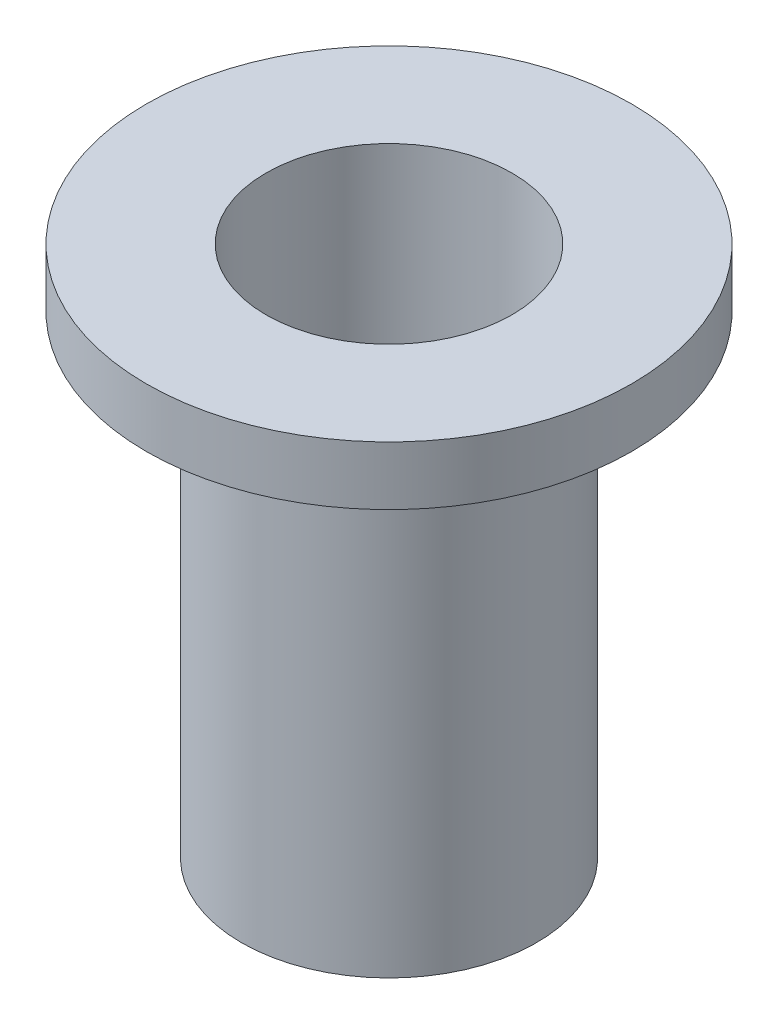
from build123d import *


with BuildPart() as part:
    # Sketch1 → Revolve1 (revolve)
    with BuildSketch(Plane.XY, mode=Mode.PRIVATE) as revolve1_sk:
        Polygon((-3.302, 14.2748), (-3.302, 0), (-3.9624, 0), (-3.9624, 12.7), (-6.5151, 12.7), (-6.5151, 14.2748), align=None)
    revolve(revolve1_sk.sketch.rotate(Axis((0, 63.933940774, 0), (0, -1, 0)), 270), axis=Axis((0, 63.933940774, 0), (0, -1, 0)))


solid = part.part
